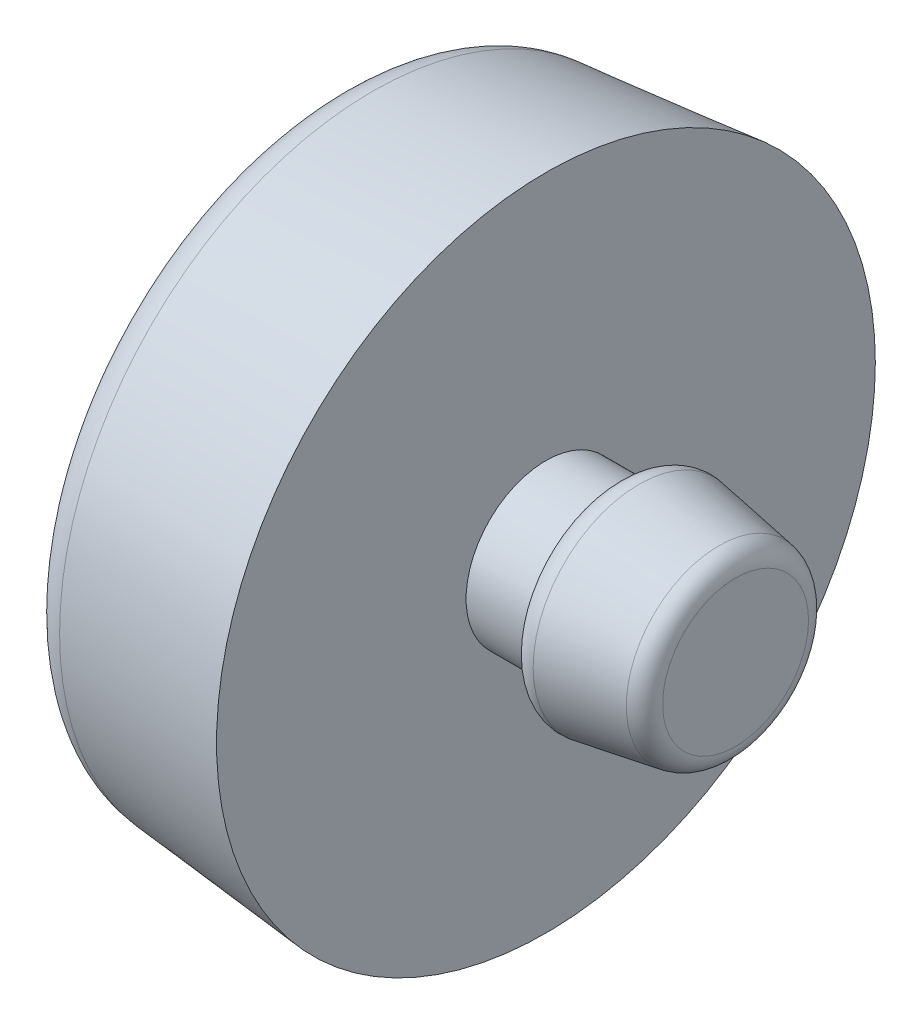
from build123d import *

# Parameters (mm, degrees)
CONG_1_R = 1
CONG_2_R = 2


with BuildPart() as part:
    # Esquisse1 → Base-R_volution (revolve)
    with BuildSketch(Plane.XY, mode=Mode.PRIVATE) as base_r_volution_sk:
        Polygon((-11, 0), (-11, 15.5), (-0.5, 16.5), (-0.5, 4), (3, 4), (3, 5.5), (9, 4.5), (9, 0), align=None)
    revolve(base_r_volution_sk.sketch.rotate(Axis((57, 0, 0), (-1, 0, 0)), 90), axis=Axis((57, 0, 0), (-1, 0, 0)))

    # Cong_1
    cong_1_edges = [part.edges().sort_by_distance(p)[0] for p in [
        (3, 0, 5.5),
        (9, 0, 4.5),
    ]]
    fillet(cong_1_edges, radius=CONG_1_R)

    # Cong_2
    cong_2_edges = [part.edges().sort_by_distance(p)[0] for p in [
        (-11, 0, 15.5),
    ]]
    fillet(cong_2_edges, radius=CONG_2_R)


solid = part.part
